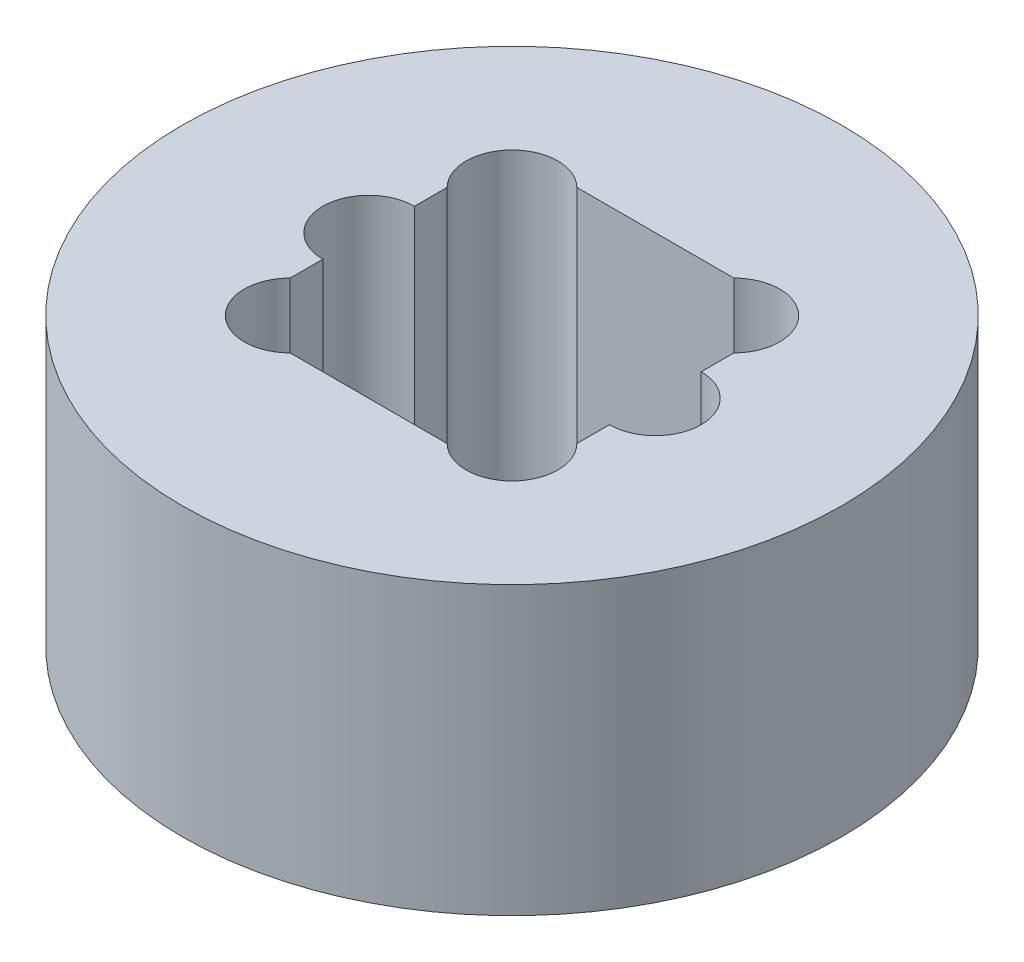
ISO-10303-21;
HEADER;
FILE_DESCRIPTION(('STEP AP214'),'2;1');
FILE_NAME('part.step','',(''),(''),'','','');
FILE_SCHEMA(('AUTOMOTIVE_DESIGN { 1 0 10303 214 1 1 1 1 }'));
ENDSEC;
DATA;
#1=APPLICATION_CONTEXT('core data for automotive mechanical design processes');
#2=APPLICATION_PROTOCOL_DEFINITION('international standard','automotive_design',2000,#1);
#3=PRODUCT_CONTEXT('',#1,'mechanical');
#4=PRODUCT('Part','Part','',(#3));
#5=PRODUCT_RELATED_PRODUCT_CATEGORY('part','',(#4));
#6=PRODUCT_DEFINITION_FORMATION('','',#4);
#7=PRODUCT_DEFINITION_CONTEXT('part definition',#1,'design');
#8=PRODUCT_DEFINITION('design','',#6,#7);
#9=PRODUCT_DEFINITION_SHAPE('','',#8);
#10=(LENGTH_UNIT() NAMED_UNIT(*) SI_UNIT(.MILLI.,.METRE.));
#11=(NAMED_UNIT(*) PLANE_ANGLE_UNIT() SI_UNIT($,.RADIAN.));
#12=(NAMED_UNIT(*) SI_UNIT($,.STERADIAN.) SOLID_ANGLE_UNIT());
#13=UNCERTAINTY_MEASURE_WITH_UNIT(LENGTH_MEASURE(1.E-05),#10,'distance_accuracy_value','');
#14=(GEOMETRIC_REPRESENTATION_CONTEXT(3) GLOBAL_UNCERTAINTY_ASSIGNED_CONTEXT((#13)) GLOBAL_UNIT_ASSIGNED_CONTEXT((#10,
#11,#12)) REPRESENTATION_CONTEXT('',''));
#15=CARTESIAN_POINT('',(0.,0.,0.));
#16=DIRECTION('',(0.,0.,1.));
#17=DIRECTION('',(1.,0.,0.));
#18=AXIS2_PLACEMENT_3D('',#15,#16,#17);
#19=CARTESIAN_POINT('',(5.,0.,2.73725830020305));
#20=DIRECTION('',(1.,0.,0.));
#21=DIRECTION('',(0.,0.,-1.));
#22=AXIS2_PLACEMENT_3D('',#19,#20,#21);
#23=PLANE('',#22);
#24=DIRECTION('',(0.,0.,-1.));
#25=VECTOR('',#24,1.);
#26=CARTESIAN_POINT('',(5.,10.,2.73725830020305));
#27=LINE('',#26,#25);
#28=CARTESIAN_POINT('',(5.,10.,2.73725830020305));
#29=VERTEX_POINT('',#28);
#30=CARTESIAN_POINT('',(5.,10.,1.6));
#31=VERTEX_POINT('',#30);
#32=EDGE_CURVE('E131',#29,#31,#27,.T.);
#33=ORIENTED_EDGE('',*,*,#32,.T.);
#34=DIRECTION('',(0.,-1.,0.));
#35=VECTOR('',#34,1.);
#36=CARTESIAN_POINT('',(5.,10.,1.6));
#37=LINE('',#36,#35);
#38=CARTESIAN_POINT('',(5.,0.,1.6));
#39=VERTEX_POINT('',#38);
#40=EDGE_CURVE('E11',#31,#39,#37,.T.);
#41=ORIENTED_EDGE('',*,*,#40,.T.);
#42=DIRECTION('',(0.,0.,-1.));
#43=VECTOR('',#42,1.);
#44=CARTESIAN_POINT('',(5.,0.,2.73725830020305));
#45=LINE('',#44,#43);
#46=CARTESIAN_POINT('',(5.,0.,2.73725830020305));
#47=VERTEX_POINT('',#46);
#48=EDGE_CURVE('E128',#47,#39,#45,.T.);
#49=ORIENTED_EDGE('',*,*,#48,.F.);
#50=DIRECTION('',(0.,1.,0.));
#51=VECTOR('',#50,1.);
#52=CARTESIAN_POINT('',(5.,0.,2.73725830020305));
#53=LINE('',#52,#51);
#54=EDGE_CURVE('E192',#47,#29,#53,.T.);
#55=ORIENTED_EDGE('',*,*,#54,.T.);
#56=EDGE_LOOP('',(#33,#41,#49,#55));
#57=FACE_BOUND('',#56,.T.);
#58=ADVANCED_FACE('F32',(#57),#23,.F.);
#59=CARTESIAN_POINT('',(-5.,0.,2.73725830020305));
#60=DIRECTION('',(-1.,0.,0.));
#61=DIRECTION('',(0.,0.,1.));
#62=AXIS2_PLACEMENT_3D('',#59,#60,#61);
#63=PLANE('',#62);
#64=DIRECTION('',(0.,0.,1.));
#65=VECTOR('',#64,1.);
#66=CARTESIAN_POINT('',(-5.,10.,2.73725830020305));
#67=LINE('',#66,#65);
#68=CARTESIAN_POINT('',(-5.,10.,-2.73725830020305));
#69=VERTEX_POINT('',#68);
#70=CARTESIAN_POINT('',(-5.,10.,-1.6));
#71=VERTEX_POINT('',#70);
#72=EDGE_CURVE('E175',#69,#71,#67,.T.);
#73=ORIENTED_EDGE('',*,*,#72,.T.);
#74=DIRECTION('',(0.,-1.,0.));
#75=VECTOR('',#74,1.);
#76=CARTESIAN_POINT('',(-5.,10.,-1.6));
#77=LINE('',#76,#75);
#78=CARTESIAN_POINT('',(-5.,0.,-1.6));
#79=VERTEX_POINT('',#78);
#80=EDGE_CURVE('E205',#71,#79,#77,.T.);
#81=ORIENTED_EDGE('',*,*,#80,.T.);
#82=DIRECTION('',(0.,0.,1.));
#83=VECTOR('',#82,1.);
#84=CARTESIAN_POINT('',(-5.,0.,2.73725830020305));
#85=LINE('',#84,#83);
#86=CARTESIAN_POINT('',(-5.,0.,-2.73725830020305));
#87=VERTEX_POINT('',#86);
#88=EDGE_CURVE('E151',#87,#79,#85,.T.);
#89=ORIENTED_EDGE('',*,*,#88,.F.);
#90=DIRECTION('',(0.,1.,0.));
#91=VECTOR('',#90,1.);
#92=CARTESIAN_POINT('',(-5.,0.,-2.73725830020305));
#93=LINE('',#92,#91);
#94=EDGE_CURVE('E183',#87,#69,#93,.T.);
#95=ORIENTED_EDGE('',*,*,#94,.T.);
#96=EDGE_LOOP('',(#73,#81,#89,#95));
#97=FACE_BOUND('',#96,.T.);
#98=ADVANCED_FACE('F229',(#97),#63,.F.);
#99=CARTESIAN_POINT('',(0.,10.,0.));
#100=DIRECTION('',(0.,-1.,0.));
#101=DIRECTION('',(0.,0.,-1.));
#102=AXIS2_PLACEMENT_3D('',#99,#100,#101);
#103=CYLINDRICAL_SURFACE('',#102,11.5);
#104=CARTESIAN_POINT('',(0.,10.,0.));
#105=DIRECTION('',(0.,1.,0.));
#106=DIRECTION('',(0.,0.,1.));
#107=AXIS2_PLACEMENT_3D('',#104,#105,#106);
#108=CIRCLE('',#107,11.5);
#109=CARTESIAN_POINT('',(0.,10.,11.5));
#110=VERTEX_POINT('',#109);
#111=EDGE_CURVE('E198',#110,#110,#108,.T.);
#112=ORIENTED_EDGE('',*,*,#111,.F.);
#113=EDGE_LOOP('',(#112));
#114=FACE_BOUND('',#113,.T.);
#115=CARTESIAN_POINT('',(0.,0.,0.));
#116=DIRECTION('',(0.,1.,0.));
#117=DIRECTION('',(0.,0.,1.));
#118=AXIS2_PLACEMENT_3D('',#115,#116,#117);
#119=CIRCLE('',#118,11.5);
#120=CARTESIAN_POINT('',(0.,0.,11.5));
#121=VERTEX_POINT('',#120);
#122=EDGE_CURVE('E182',#121,#121,#119,.T.);
#123=ORIENTED_EDGE('',*,*,#122,.T.);
#124=EDGE_LOOP('',(#123));
#125=FACE_BOUND('',#124,.T.);
#126=ADVANCED_FACE('F34',(#114,#125),#103,.T.);
#127=CARTESIAN_POINT('',(0.,10.,0.));
#128=DIRECTION('',(0.,1.,0.));
#129=DIRECTION('',(0.,0.,1.));
#130=AXIS2_PLACEMENT_3D('',#127,#128,#129);
#131=PLANE('',#130);
#132=CARTESIAN_POINT('',(5.,10.,0.));
#133=DIRECTION('',(0.,-1.,0.));
#134=DIRECTION('',(0.,0.,1.));
#135=AXIS2_PLACEMENT_3D('',#132,#133,#134);
#136=CIRCLE('',#135,1.6);
#137=CARTESIAN_POINT('',(5.,10.,-1.6));
#138=VERTEX_POINT('',#137);
#139=EDGE_CURVE('E47',#138,#31,#136,.T.);
#140=ORIENTED_EDGE('',*,*,#139,.T.);
#141=ORIENTED_EDGE('',*,*,#32,.F.);
#142=CARTESIAN_POINT('',(3.86862915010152,10.,3.86862915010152));
#143=DIRECTION('',(0.,1.,0.));
#144=DIRECTION('',(0.,0.,1.));
#145=AXIS2_PLACEMENT_3D('',#142,#143,#144);
#146=CIRCLE('',#145,1.6);
#147=CARTESIAN_POINT('',(2.73725830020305,10.,5.));
#148=VERTEX_POINT('',#147);
#149=EDGE_CURVE('E160',#148,#29,#146,.T.);
#150=ORIENTED_EDGE('',*,*,#149,.F.);
#151=DIRECTION('',(1.,0.,0.));
#152=VECTOR('',#151,1.);
#153=CARTESIAN_POINT('',(-2.73725830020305,10.,5.));
#154=LINE('',#153,#152);
#155=CARTESIAN_POINT('',(-2.73725830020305,10.,5.));
#156=VERTEX_POINT('',#155);
#157=EDGE_CURVE('E157',#156,#148,#154,.T.);
#158=ORIENTED_EDGE('',*,*,#157,.F.);
#159=CARTESIAN_POINT('',(-3.86862915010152,10.,3.86862915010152));
#160=DIRECTION('',(0.,1.,0.));
#161=DIRECTION('',(0.,0.,-1.));
#162=AXIS2_PLACEMENT_3D('',#159,#160,#161);
#163=CIRCLE('',#162,1.6);
#164=CARTESIAN_POINT('',(-5.,10.,2.73725830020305));
#165=VERTEX_POINT('',#164);
#166=EDGE_CURVE('E155',#165,#156,#163,.T.);
#167=ORIENTED_EDGE('',*,*,#166,.F.);
#168=CARTESIAN_POINT('',(-5.,10.,1.6));
#169=VERTEX_POINT('',#168);
#170=EDGE_CURVE('E174',#169,#165,#67,.T.);
#171=ORIENTED_EDGE('',*,*,#170,.F.);
#172=CARTESIAN_POINT('',(-5.,10.,0.));
#173=DIRECTION('',(0.,-1.,0.));
#174=DIRECTION('',(0.,0.,-1.));
#175=AXIS2_PLACEMENT_3D('',#172,#173,#174);
#176=CIRCLE('',#175,1.6);
#177=EDGE_CURVE('E55',#169,#71,#176,.T.);
#178=ORIENTED_EDGE('',*,*,#177,.T.);
#179=ORIENTED_EDGE('',*,*,#72,.F.);
#180=CARTESIAN_POINT('',(-3.86862915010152,10.,-3.86862915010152));
#181=DIRECTION('',(0.,1.,0.));
#182=DIRECTION('',(0.,0.,1.));
#183=AXIS2_PLACEMENT_3D('',#180,#181,#182);
#184=CIRCLE('',#183,1.6);
#185=CARTESIAN_POINT('',(-2.73725830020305,10.,-5.));
#186=VERTEX_POINT('',#185);
#187=EDGE_CURVE('E171',#186,#69,#184,.T.);
#188=ORIENTED_EDGE('',*,*,#187,.F.);
#189=DIRECTION('',(-1.,0.,0.));
#190=VECTOR('',#189,1.);
#191=CARTESIAN_POINT('',(-2.73725830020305,10.,-5.));
#192=LINE('',#191,#190);
#193=CARTESIAN_POINT('',(2.73725830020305,10.,-5.));
#194=VERTEX_POINT('',#193);
#195=EDGE_CURVE('E168',#194,#186,#192,.T.);
#196=ORIENTED_EDGE('',*,*,#195,.F.);
#197=CARTESIAN_POINT('',(3.86862915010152,10.,-3.86862915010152));
#198=DIRECTION('',(0.,1.,0.));
#199=DIRECTION('',(0.,0.,-1.));
#200=AXIS2_PLACEMENT_3D('',#197,#198,#199);
#201=CIRCLE('',#200,1.6);
#202=CARTESIAN_POINT('',(5.,10.,-2.73725830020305));
#203=VERTEX_POINT('',#202);
#204=EDGE_CURVE('E165',#203,#194,#201,.T.);
#205=ORIENTED_EDGE('',*,*,#204,.F.);
#206=EDGE_CURVE('E163',#138,#203,#27,.T.);
#207=ORIENTED_EDGE('',*,*,#206,.F.);
#208=EDGE_LOOP('',(#140,#141,#150,#158,#167,#171,#178,#179,#188,#196,#205,#207));
#209=FACE_BOUND('',#208,.T.);
#210=ORIENTED_EDGE('',*,*,#111,.T.);
#211=EDGE_LOOP('',(#210));
#212=FACE_BOUND('',#211,.T.);
#213=ADVANCED_FACE('F213',(#209,#212),#131,.T.);
#214=CARTESIAN_POINT('',(0.,0.,0.));
#215=DIRECTION('',(0.,1.,0.));
#216=DIRECTION('',(0.,0.,1.));
#217=AXIS2_PLACEMENT_3D('',#214,#215,#216);
#218=PLANE('',#217);
#219=ORIENTED_EDGE('',*,*,#48,.T.);
#220=CARTESIAN_POINT('',(5.,0.,0.));
#221=DIRECTION('',(0.,-1.,0.));
#222=DIRECTION('',(0.,0.,1.));
#223=AXIS2_PLACEMENT_3D('',#220,#221,#222);
#224=CIRCLE('',#223,1.6);
#225=CARTESIAN_POINT('',(5.,0.,-1.6));
#226=VERTEX_POINT('',#225);
#227=EDGE_CURVE('E119',#226,#39,#224,.T.);
#228=ORIENTED_EDGE('',*,*,#227,.F.);
#229=CARTESIAN_POINT('',(5.,0.,-2.73725830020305));
#230=VERTEX_POINT('',#229);
#231=EDGE_CURVE('E137',#226,#230,#45,.T.);
#232=ORIENTED_EDGE('',*,*,#231,.T.);
#233=CARTESIAN_POINT('',(3.86862915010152,0.,-3.86862915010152));
#234=DIRECTION('',(0.,1.,0.));
#235=DIRECTION('',(0.,0.,-1.));
#236=AXIS2_PLACEMENT_3D('',#233,#234,#235);
#237=CIRCLE('',#236,1.6);
#238=CARTESIAN_POINT('',(2.73725830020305,0.,-5.));
#239=VERTEX_POINT('',#238);
#240=EDGE_CURVE('E136',#230,#239,#237,.T.);
#241=ORIENTED_EDGE('',*,*,#240,.T.);
#242=DIRECTION('',(-1.,0.,0.));
#243=VECTOR('',#242,1.);
#244=CARTESIAN_POINT('',(-2.73725830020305,0.,-5.));
#245=LINE('',#244,#243);
#246=CARTESIAN_POINT('',(-2.73725830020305,0.,-5.));
#247=VERTEX_POINT('',#246);
#248=EDGE_CURVE('E140',#239,#247,#245,.T.);
#249=ORIENTED_EDGE('',*,*,#248,.T.);
#250=CARTESIAN_POINT('',(-3.86862915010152,0.,-3.86862915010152));
#251=DIRECTION('',(0.,1.,0.));
#252=DIRECTION('',(0.,0.,1.));
#253=AXIS2_PLACEMENT_3D('',#250,#251,#252);
#254=CIRCLE('',#253,1.6);
#255=EDGE_CURVE('E147',#247,#87,#254,.T.);
#256=ORIENTED_EDGE('',*,*,#255,.T.);
#257=ORIENTED_EDGE('',*,*,#88,.T.);
#258=CARTESIAN_POINT('',(-5.,0.,0.));
#259=DIRECTION('',(0.,-1.,0.));
#260=DIRECTION('',(0.,0.,-1.));
#261=AXIS2_PLACEMENT_3D('',#258,#259,#260);
#262=CIRCLE('',#261,1.6);
#263=CARTESIAN_POINT('',(-5.,0.,1.6));
#264=VERTEX_POINT('',#263);
#265=EDGE_CURVE('E231',#264,#79,#262,.T.);
#266=ORIENTED_EDGE('',*,*,#265,.F.);
#267=CARTESIAN_POINT('',(-5.,0.,2.73725830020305));
#268=VERTEX_POINT('',#267);
#269=EDGE_CURVE('E150',#264,#268,#85,.T.);
#270=ORIENTED_EDGE('',*,*,#269,.T.);
#271=CARTESIAN_POINT('',(-3.86862915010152,0.,3.86862915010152));
#272=DIRECTION('',(0.,1.,0.));
#273=DIRECTION('',(0.,0.,-1.));
#274=AXIS2_PLACEMENT_3D('',#271,#272,#273);
#275=CIRCLE('',#274,1.6);
#276=CARTESIAN_POINT('',(-2.73725830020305,0.,5.));
#277=VERTEX_POINT('',#276);
#278=EDGE_CURVE('E178',#268,#277,#275,.T.);
#279=ORIENTED_EDGE('',*,*,#278,.T.);
#280=DIRECTION('',(1.,0.,0.));
#281=VECTOR('',#280,1.);
#282=CARTESIAN_POINT('',(-2.73725830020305,0.,5.));
#283=LINE('',#282,#281);
#284=CARTESIAN_POINT('',(2.73725830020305,0.,5.));
#285=VERTEX_POINT('',#284);
#286=EDGE_CURVE('E244',#277,#285,#283,.T.);
#287=ORIENTED_EDGE('',*,*,#286,.T.);
#288=CARTESIAN_POINT('',(3.86862915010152,0.,3.86862915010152));
#289=DIRECTION('',(0.,1.,0.));
#290=DIRECTION('',(0.,0.,1.));
#291=AXIS2_PLACEMENT_3D('',#288,#289,#290);
#292=CIRCLE('',#291,1.6);
#293=EDGE_CURVE('E135',#285,#47,#292,.T.);
#294=ORIENTED_EDGE('',*,*,#293,.T.);
#295=EDGE_LOOP('',(#219,#228,#232,#241,#249,#256,#257,#266,#270,#279,#287,#294));
#296=FACE_BOUND('',#295,.T.);
#297=ORIENTED_EDGE('',*,*,#122,.F.);
#298=EDGE_LOOP('',(#297));
#299=FACE_BOUND('',#298,.T.);
#300=ADVANCED_FACE('F132',(#296,#299),#218,.F.);
#301=CARTESIAN_POINT('',(-3.86862915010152,0.,3.86862915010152));
#302=DIRECTION('',(0.,1.,0.));
#303=DIRECTION('',(0.,0.,1.));
#304=AXIS2_PLACEMENT_3D('',#301,#302,#303);
#305=CYLINDRICAL_SURFACE('',#304,1.6);
#306=ORIENTED_EDGE('',*,*,#166,.T.);
#307=DIRECTION('',(0.,1.,0.));
#308=VECTOR('',#307,1.);
#309=CARTESIAN_POINT('',(-2.73725830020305,0.,5.));
#310=LINE('',#309,#308);
#311=EDGE_CURVE('E154',#277,#156,#310,.T.);
#312=ORIENTED_EDGE('',*,*,#311,.F.);
#313=ORIENTED_EDGE('',*,*,#278,.F.);
#314=DIRECTION('',(0.,1.,0.));
#315=VECTOR('',#314,1.);
#316=CARTESIAN_POINT('',(-5.,0.,2.73725830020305));
#317=LINE('',#316,#315);
#318=EDGE_CURVE('E179',#268,#165,#317,.T.);
#319=ORIENTED_EDGE('',*,*,#318,.T.);
#320=EDGE_LOOP('',(#306,#312,#313,#319));
#321=FACE_BOUND('',#320,.T.);
#322=ADVANCED_FACE('F242',(#321),#305,.F.);
#323=ORIENTED_EDGE('',*,*,#269,.F.);
#324=DIRECTION('',(0.,-1.,0.));
#325=VECTOR('',#324,1.);
#326=CARTESIAN_POINT('',(-5.,10.,1.6));
#327=LINE('',#326,#325);
#328=EDGE_CURVE('E201',#264,#169,#327,.F.);
#329=ORIENTED_EDGE('',*,*,#328,.T.);
#330=ORIENTED_EDGE('',*,*,#170,.T.);
#331=ORIENTED_EDGE('',*,*,#318,.F.);
#332=EDGE_LOOP('',(#323,#329,#330,#331));
#333=FACE_BOUND('',#332,.T.);
#334=ADVANCED_FACE('F237',(#333),#63,.F.);
#335=CARTESIAN_POINT('',(-3.86862915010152,0.,-3.86862915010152));
#336=DIRECTION('',(0.,1.,0.));
#337=DIRECTION('',(0.,0.,1.));
#338=AXIS2_PLACEMENT_3D('',#335,#336,#337);
#339=CYLINDRICAL_SURFACE('',#338,1.6);
#340=ORIENTED_EDGE('',*,*,#187,.T.);
#341=ORIENTED_EDGE('',*,*,#94,.F.);
#342=ORIENTED_EDGE('',*,*,#255,.F.);
#343=DIRECTION('',(0.,1.,0.));
#344=VECTOR('',#343,1.);
#345=CARTESIAN_POINT('',(-2.73725830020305,0.,-5.));
#346=LINE('',#345,#344);
#347=EDGE_CURVE('E185',#247,#186,#346,.T.);
#348=ORIENTED_EDGE('',*,*,#347,.T.);
#349=EDGE_LOOP('',(#340,#341,#342,#348));
#350=FACE_BOUND('',#349,.T.);
#351=ADVANCED_FACE('F225',(#350),#339,.F.);
#352=CARTESIAN_POINT('',(-2.73725830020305,0.,-5.));
#353=DIRECTION('',(0.,0.,-1.));
#354=DIRECTION('',(-1.,0.,0.));
#355=AXIS2_PLACEMENT_3D('',#352,#353,#354);
#356=PLANE('',#355);
#357=ORIENTED_EDGE('',*,*,#195,.T.);
#358=ORIENTED_EDGE('',*,*,#347,.F.);
#359=ORIENTED_EDGE('',*,*,#248,.F.);
#360=DIRECTION('',(0.,1.,0.));
#361=VECTOR('',#360,1.);
#362=CARTESIAN_POINT('',(2.73725830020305,0.,-5.));
#363=LINE('',#362,#361);
#364=EDGE_CURVE('E187',#239,#194,#363,.T.);
#365=ORIENTED_EDGE('',*,*,#364,.T.);
#366=EDGE_LOOP('',(#357,#358,#359,#365));
#367=FACE_BOUND('',#366,.T.);
#368=ADVANCED_FACE('F223',(#367),#356,.F.);
#369=CARTESIAN_POINT('',(3.86862915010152,0.,-3.86862915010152));
#370=DIRECTION('',(0.,1.,0.));
#371=DIRECTION('',(0.,0.,1.));
#372=AXIS2_PLACEMENT_3D('',#369,#370,#371);
#373=CYLINDRICAL_SURFACE('',#372,1.6);
#374=ORIENTED_EDGE('',*,*,#204,.T.);
#375=ORIENTED_EDGE('',*,*,#364,.F.);
#376=ORIENTED_EDGE('',*,*,#240,.F.);
#377=DIRECTION('',(0.,1.,0.));
#378=VECTOR('',#377,1.);
#379=CARTESIAN_POINT('',(5.,0.,-2.73725830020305));
#380=LINE('',#379,#378);
#381=EDGE_CURVE('E189',#230,#203,#380,.T.);
#382=ORIENTED_EDGE('',*,*,#381,.T.);
#383=EDGE_LOOP('',(#374,#375,#376,#382));
#384=FACE_BOUND('',#383,.T.);
#385=ADVANCED_FACE('F218',(#384),#373,.F.);
#386=ORIENTED_EDGE('',*,*,#231,.F.);
#387=DIRECTION('',(0.,-1.,0.));
#388=VECTOR('',#387,1.);
#389=CARTESIAN_POINT('',(5.,10.,-1.6));
#390=LINE('',#389,#388);
#391=EDGE_CURVE('E40',#226,#138,#390,.F.);
#392=ORIENTED_EDGE('',*,*,#391,.T.);
#393=ORIENTED_EDGE('',*,*,#206,.T.);
#394=ORIENTED_EDGE('',*,*,#381,.F.);
#395=EDGE_LOOP('',(#386,#392,#393,#394));
#396=FACE_BOUND('',#395,.T.);
#397=ADVANCED_FACE('F209',(#396),#23,.F.);
#398=CARTESIAN_POINT('',(3.86862915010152,0.,3.86862915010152));
#399=DIRECTION('',(0.,1.,0.));
#400=DIRECTION('',(0.,0.,1.));
#401=AXIS2_PLACEMENT_3D('',#398,#399,#400);
#402=CYLINDRICAL_SURFACE('',#401,1.6);
#403=ORIENTED_EDGE('',*,*,#149,.T.);
#404=ORIENTED_EDGE('',*,*,#54,.F.);
#405=ORIENTED_EDGE('',*,*,#293,.F.);
#406=DIRECTION('',(0.,1.,0.));
#407=VECTOR('',#406,1.);
#408=CARTESIAN_POINT('',(2.73725830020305,0.,5.));
#409=LINE('',#408,#407);
#410=EDGE_CURVE('E194',#285,#148,#409,.T.);
#411=ORIENTED_EDGE('',*,*,#410,.T.);
#412=EDGE_LOOP('',(#403,#404,#405,#411));
#413=FACE_BOUND('',#412,.T.);
#414=ADVANCED_FACE('F254',(#413),#402,.F.);
#415=CARTESIAN_POINT('',(-2.73725830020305,0.,5.));
#416=DIRECTION('',(0.,0.,1.));
#417=DIRECTION('',(1.,0.,0.));
#418=AXIS2_PLACEMENT_3D('',#415,#416,#417);
#419=PLANE('',#418);
#420=ORIENTED_EDGE('',*,*,#157,.T.);
#421=ORIENTED_EDGE('',*,*,#410,.F.);
#422=ORIENTED_EDGE('',*,*,#286,.F.);
#423=ORIENTED_EDGE('',*,*,#311,.T.);
#424=EDGE_LOOP('',(#420,#421,#422,#423));
#425=FACE_BOUND('',#424,.T.);
#426=ADVANCED_FACE('F251',(#425),#419,.F.);
#427=CARTESIAN_POINT('',(-5.,10.,0.));
#428=DIRECTION('',(0.,-1.,0.));
#429=DIRECTION('',(0.,0.,-1.));
#430=AXIS2_PLACEMENT_3D('',#427,#428,#429);
#431=CYLINDRICAL_SURFACE('',#430,1.6);
#432=ORIENTED_EDGE('',*,*,#177,.F.);
#433=ORIENTED_EDGE('',*,*,#328,.F.);
#434=ORIENTED_EDGE('',*,*,#265,.T.);
#435=ORIENTED_EDGE('',*,*,#80,.F.);
#436=EDGE_LOOP('',(#432,#433,#434,#435));
#437=FACE_BOUND('',#436,.T.);
#438=ADVANCED_FACE('F261',(#437),#431,.F.);
#439=CARTESIAN_POINT('',(5.,10.,0.));
#440=DIRECTION('',(0.,-1.,0.));
#441=DIRECTION('',(0.,0.,-1.));
#442=AXIS2_PLACEMENT_3D('',#439,#440,#441);
#443=CYLINDRICAL_SURFACE('',#442,1.6);
#444=ORIENTED_EDGE('',*,*,#139,.F.);
#445=ORIENTED_EDGE('',*,*,#391,.F.);
#446=ORIENTED_EDGE('',*,*,#227,.T.);
#447=ORIENTED_EDGE('',*,*,#40,.F.);
#448=EDGE_LOOP('',(#444,#445,#446,#447));
#449=FACE_BOUND('',#448,.T.);
#450=ADVANCED_FACE('F120',(#449),#443,.F.);
#451=CLOSED_SHELL('',(#58,#98,#126,#213,#300,#322,#334,#351,#368,#385,#397,#414,#426,#438,#450));
#452=MANIFOLD_SOLID_BREP('B2',#451);
#453=ADVANCED_BREP_SHAPE_REPRESENTATION('',(#18,#452),#14);
#454=SHAPE_DEFINITION_REPRESENTATION(#9,#453);
ENDSEC;
END-ISO-10303-21;
